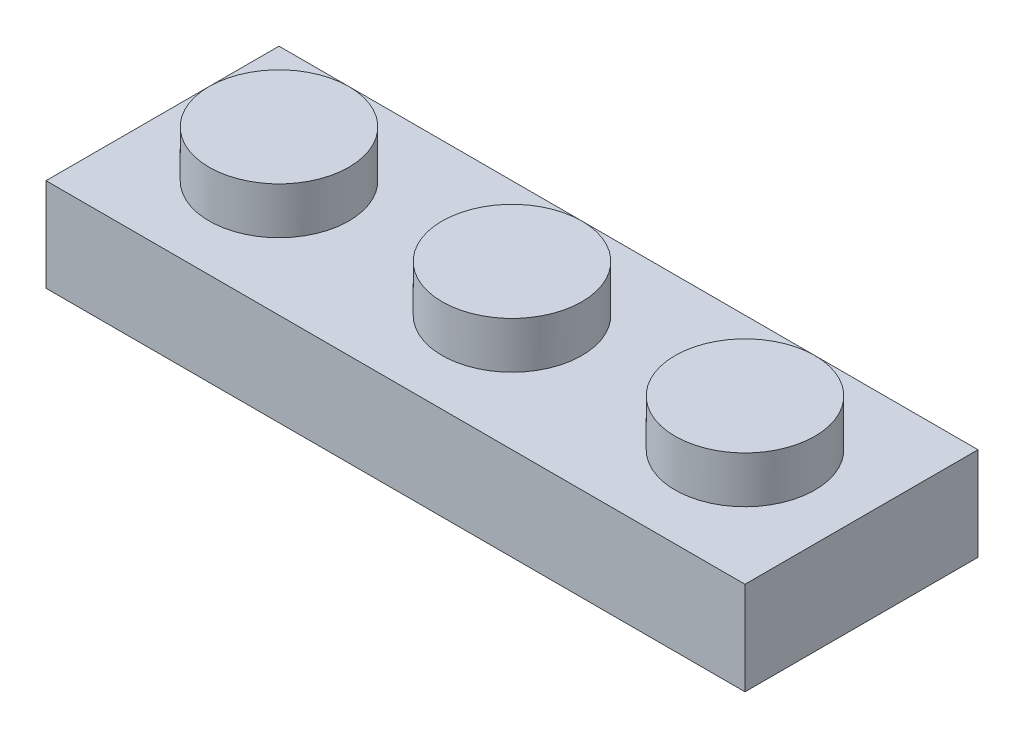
ISO-10303-21;
HEADER;
FILE_DESCRIPTION(('STEP AP214'),'2;1');
FILE_NAME('part.step','',(''),(''),'','','');
FILE_SCHEMA(('AUTOMOTIVE_DESIGN { 1 0 10303 214 1 1 1 1 }'));
ENDSEC;
DATA;
#1=APPLICATION_CONTEXT('core data for automotive mechanical design processes');
#2=APPLICATION_PROTOCOL_DEFINITION('international standard','automotive_design',2000,#1);
#3=PRODUCT_CONTEXT('',#1,'mechanical');
#4=PRODUCT('Part','Part','',(#3));
#5=PRODUCT_RELATED_PRODUCT_CATEGORY('part','',(#4));
#6=PRODUCT_DEFINITION_FORMATION('','',#4);
#7=PRODUCT_DEFINITION_CONTEXT('part definition',#1,'design');
#8=PRODUCT_DEFINITION('design','',#6,#7);
#9=PRODUCT_DEFINITION_SHAPE('','',#8);
#10=(LENGTH_UNIT() NAMED_UNIT(*) SI_UNIT(.MILLI.,.METRE.));
#11=(NAMED_UNIT(*) PLANE_ANGLE_UNIT() SI_UNIT($,.RADIAN.));
#12=(NAMED_UNIT(*) SI_UNIT($,.STERADIAN.) SOLID_ANGLE_UNIT());
#13=UNCERTAINTY_MEASURE_WITH_UNIT(LENGTH_MEASURE(1.E-05),#10,'distance_accuracy_value','');
#14=(GEOMETRIC_REPRESENTATION_CONTEXT(3) GLOBAL_UNCERTAINTY_ASSIGNED_CONTEXT((#13)) GLOBAL_UNIT_ASSIGNED_CONTEXT((#10,
#11,#12)) REPRESENTATION_CONTEXT('',''));
#15=CARTESIAN_POINT('',(0.,0.,0.));
#16=DIRECTION('',(0.,0.,1.));
#17=DIRECTION('',(1.,0.,0.));
#18=AXIS2_PLACEMENT_3D('',#15,#16,#17);
#19=CARTESIAN_POINT('',(0.,0.,0.));
#20=DIRECTION('',(0.,-1.,0.));
#21=DIRECTION('',(0.,0.,-1.));
#22=AXIS2_PLACEMENT_3D('',#19,#20,#21);
#23=PLANE('',#22);
#24=DIRECTION('',(0.,0.,-1.));
#25=VECTOR('',#24,1.);
#26=CARTESIAN_POINT('',(-1.6,0.,-4.));
#27=LINE('',#26,#25);
#28=CARTESIAN_POINT('',(-1.6,0.,2.4));
#29=VERTEX_POINT('',#28);
#30=CARTESIAN_POINT('',(-1.6,0.,-2.4));
#31=VERTEX_POINT('',#30);
#32=EDGE_CURVE('E53',#29,#31,#27,.T.);
#33=ORIENTED_EDGE('',*,*,#32,.T.);
#34=DIRECTION('',(-1.,0.,0.));
#35=VECTOR('',#34,1.);
#36=CARTESIAN_POINT('',(0.,0.,-2.4));
#37=LINE('',#36,#35);
#38=CARTESIAN_POINT('',(-22.4,0.,-2.4));
#39=VERTEX_POINT('',#38);
#40=EDGE_CURVE('E174',#31,#39,#37,.T.);
#41=ORIENTED_EDGE('',*,*,#40,.T.);
#42=DIRECTION('',(0.,0.,1.));
#43=VECTOR('',#42,1.);
#44=CARTESIAN_POINT('',(-22.4,0.,0.));
#45=LINE('',#44,#43);
#46=CARTESIAN_POINT('',(-22.4,0.,2.4));
#47=VERTEX_POINT('',#46);
#48=EDGE_CURVE('E181',#39,#47,#45,.T.);
#49=ORIENTED_EDGE('',*,*,#48,.T.);
#50=DIRECTION('',(1.,0.,0.));
#51=VECTOR('',#50,1.);
#52=CARTESIAN_POINT('',(0.,0.,2.4));
#53=LINE('',#52,#51);
#54=EDGE_CURVE('E58',#47,#29,#53,.T.);
#55=ORIENTED_EDGE('',*,*,#54,.T.);
#56=EDGE_LOOP('',(#33,#41,#49,#55));
#57=FACE_BOUND('',#56,.T.);
#58=DIRECTION('',(0.,0.,-1.));
#59=VECTOR('',#58,1.);
#60=CARTESIAN_POINT('',(0.,0.,4.));
#61=LINE('',#60,#59);
#62=CARTESIAN_POINT('',(0.,0.,4.));
#63=VERTEX_POINT('',#62);
#64=CARTESIAN_POINT('',(0.,0.,-4.));
#65=VERTEX_POINT('',#64);
#66=EDGE_CURVE('E119',#63,#65,#61,.T.);
#67=ORIENTED_EDGE('',*,*,#66,.F.);
#68=DIRECTION('',(1.,0.,0.));
#69=VECTOR('',#68,1.);
#70=CARTESIAN_POINT('',(-24.,0.,4.));
#71=LINE('',#70,#69);
#72=CARTESIAN_POINT('',(-24.,0.,4.));
#73=VERTEX_POINT('',#72);
#74=EDGE_CURVE('E104',#73,#63,#71,.T.);
#75=ORIENTED_EDGE('',*,*,#74,.F.);
#76=DIRECTION('',(0.,0.,1.));
#77=VECTOR('',#76,1.);
#78=CARTESIAN_POINT('',(-24.,0.,4.));
#79=LINE('',#78,#77);
#80=CARTESIAN_POINT('',(-24.,0.,-4.));
#81=VERTEX_POINT('',#80);
#82=EDGE_CURVE('E116',#81,#73,#79,.T.);
#83=ORIENTED_EDGE('',*,*,#82,.F.);
#84=DIRECTION('',(-1.,0.,0.));
#85=VECTOR('',#84,1.);
#86=CARTESIAN_POINT('',(-24.,0.,-4.));
#87=LINE('',#86,#85);
#88=EDGE_CURVE('E120',#65,#81,#87,.T.);
#89=ORIENTED_EDGE('',*,*,#88,.F.);
#90=EDGE_LOOP('',(#67,#75,#83,#89));
#91=FACE_BOUND('',#90,.T.);
#92=ADVANCED_FACE('F38',(#57,#91),#23,.T.);
#93=CARTESIAN_POINT('',(-24.,3.2,-4.));
#94=DIRECTION('',(0.,0.,1.));
#95=DIRECTION('',(1.,0.,0.));
#96=AXIS2_PLACEMENT_3D('',#93,#94,#95);
#97=PLANE('',#96);
#98=DIRECTION('',(-1.,0.,0.));
#99=VECTOR('',#98,1.);
#100=CARTESIAN_POINT('',(-24.,3.2,-4.));
#101=LINE('',#100,#99);
#102=CARTESIAN_POINT('',(0.,3.2,-4.));
#103=VERTEX_POINT('',#102);
#104=CARTESIAN_POINT('',(-24.,3.2,-4.));
#105=VERTEX_POINT('',#104);
#106=EDGE_CURVE('E115',#103,#105,#101,.T.);
#107=ORIENTED_EDGE('',*,*,#106,.F.);
#108=DIRECTION('',(0.,1.,0.));
#109=VECTOR('',#108,1.);
#110=CARTESIAN_POINT('',(0.,0.,-4.));
#111=LINE('',#110,#109);
#112=EDGE_CURVE('E123',#65,#103,#111,.T.);
#113=ORIENTED_EDGE('',*,*,#112,.F.);
#114=ORIENTED_EDGE('',*,*,#88,.T.);
#115=DIRECTION('',(0.,-1.,0.));
#116=VECTOR('',#115,1.);
#117=CARTESIAN_POINT('',(-24.,3.2,-4.));
#118=LINE('',#117,#116);
#119=EDGE_CURVE('E200',#105,#81,#118,.T.);
#120=ORIENTED_EDGE('',*,*,#119,.F.);
#121=EDGE_LOOP('',(#107,#113,#114,#120));
#122=FACE_BOUND('',#121,.T.);
#123=ADVANCED_FACE('F40',(#122),#97,.F.);
#124=CARTESIAN_POINT('',(-24.,3.2,4.));
#125=DIRECTION('',(1.,0.,0.));
#126=DIRECTION('',(0.,0.,-1.));
#127=AXIS2_PLACEMENT_3D('',#124,#125,#126);
#128=PLANE('',#127);
#129=ORIENTED_EDGE('',*,*,#82,.T.);
#130=DIRECTION('',(0.,-1.,0.));
#131=VECTOR('',#130,1.);
#132=CARTESIAN_POINT('',(-24.,3.2,4.));
#133=LINE('',#132,#131);
#134=CARTESIAN_POINT('',(-24.,3.2,4.));
#135=VERTEX_POINT('',#134);
#136=EDGE_CURVE('E112',#135,#73,#133,.T.);
#137=ORIENTED_EDGE('',*,*,#136,.F.);
#138=DIRECTION('',(0.,0.,1.));
#139=VECTOR('',#138,1.);
#140=CARTESIAN_POINT('',(-24.,3.2,4.));
#141=LINE('',#140,#139);
#142=EDGE_CURVE('E193',#105,#135,#141,.T.);
#143=ORIENTED_EDGE('',*,*,#142,.F.);
#144=ORIENTED_EDGE('',*,*,#119,.T.);
#145=EDGE_LOOP('',(#129,#137,#143,#144));
#146=FACE_BOUND('',#145,.T.);
#147=ADVANCED_FACE('F222',(#146),#128,.F.);
#148=CARTESIAN_POINT('',(-24.,3.2,4.));
#149=DIRECTION('',(0.,0.,-1.));
#150=DIRECTION('',(-1.,0.,0.));
#151=AXIS2_PLACEMENT_3D('',#148,#149,#150);
#152=PLANE('',#151);
#153=ORIENTED_EDGE('',*,*,#74,.T.);
#154=DIRECTION('',(0.,-1.,0.));
#155=VECTOR('',#154,1.);
#156=CARTESIAN_POINT('',(0.,0.,4.));
#157=LINE('',#156,#155);
#158=CARTESIAN_POINT('',(0.,3.2,4.));
#159=VERTEX_POINT('',#158);
#160=EDGE_CURVE('E109',#159,#63,#157,.T.);
#161=ORIENTED_EDGE('',*,*,#160,.F.);
#162=DIRECTION('',(1.,0.,0.));
#163=VECTOR('',#162,1.);
#164=CARTESIAN_POINT('',(-24.,3.2,4.));
#165=LINE('',#164,#163);
#166=EDGE_CURVE('E195',#135,#159,#165,.T.);
#167=ORIENTED_EDGE('',*,*,#166,.F.);
#168=ORIENTED_EDGE('',*,*,#136,.T.);
#169=EDGE_LOOP('',(#153,#161,#167,#168));
#170=FACE_BOUND('',#169,.T.);
#171=ADVANCED_FACE('F106',(#170),#152,.F.);
#172=CARTESIAN_POINT('',(0.,3.2,0.));
#173=DIRECTION('',(0.,-1.,0.));
#174=DIRECTION('',(0.,0.,-1.));
#175=AXIS2_PLACEMENT_3D('',#172,#173,#174);
#176=PLANE('',#175);
#177=CARTESIAN_POINT('',(-4.,3.2,0.));
#178=DIRECTION('',(0.,-1.,0.));
#179=DIRECTION('',(0.,0.,-1.));
#180=AXIS2_PLACEMENT_3D('',#177,#178,#179);
#181=CIRCLE('',#180,2.4);
#182=CARTESIAN_POINT('',(-4.,3.2,-2.4));
#183=VERTEX_POINT('',#182);
#184=EDGE_CURVE('E11',#183,#183,#181,.F.);
#185=ORIENTED_EDGE('',*,*,#184,.F.);
#186=EDGE_LOOP('',(#185));
#187=FACE_BOUND('',#186,.T.);
#188=CARTESIAN_POINT('',(-12.,3.2,0.));
#189=DIRECTION('',(0.,-1.,0.));
#190=DIRECTION('',(0.,0.,-1.));
#191=AXIS2_PLACEMENT_3D('',#188,#189,#190);
#192=CIRCLE('',#191,2.4);
#193=CARTESIAN_POINT('',(-12.,3.2,-2.4));
#194=VERTEX_POINT('',#193);
#195=EDGE_CURVE('E46',#194,#194,#192,.F.);
#196=ORIENTED_EDGE('',*,*,#195,.F.);
#197=EDGE_LOOP('',(#196));
#198=FACE_BOUND('',#197,.T.);
#199=CARTESIAN_POINT('',(-20.,3.2,0.));
#200=DIRECTION('',(0.,-1.,0.));
#201=DIRECTION('',(0.,0.,-1.));
#202=AXIS2_PLACEMENT_3D('',#199,#200,#201);
#203=CIRCLE('',#202,2.4);
#204=CARTESIAN_POINT('',(-20.,3.2,-2.4));
#205=VERTEX_POINT('',#204);
#206=EDGE_CURVE('E203',#205,#205,#203,.F.);
#207=ORIENTED_EDGE('',*,*,#206,.F.);
#208=EDGE_LOOP('',(#207));
#209=FACE_BOUND('',#208,.T.);
#210=ORIENTED_EDGE('',*,*,#166,.T.);
#211=DIRECTION('',(0.,0.,-1.));
#212=VECTOR('',#211,1.);
#213=CARTESIAN_POINT('',(0.,3.2,0.));
#214=LINE('',#213,#212);
#215=EDGE_CURVE('E127',#159,#103,#214,.T.);
#216=ORIENTED_EDGE('',*,*,#215,.T.);
#217=ORIENTED_EDGE('',*,*,#106,.T.);
#218=ORIENTED_EDGE('',*,*,#142,.T.);
#219=EDGE_LOOP('',(#210,#216,#217,#218));
#220=FACE_BOUND('',#219,.T.);
#221=ADVANCED_FACE('F210',(#187,#198,#209,#220),#176,.F.);
#222=CARTESIAN_POINT('',(-20.,4.8,0.));
#223=DIRECTION('',(0.,-1.,0.));
#224=DIRECTION('',(0.,0.,-1.));
#225=AXIS2_PLACEMENT_3D('',#222,#223,#224);
#226=CYLINDRICAL_SURFACE('',#225,2.4);
#227=CARTESIAN_POINT('',(-20.,4.8,0.));
#228=DIRECTION('',(0.,1.,0.));
#229=DIRECTION('',(0.,0.,1.));
#230=AXIS2_PLACEMENT_3D('',#227,#228,#229);
#231=CIRCLE('',#230,2.4);
#232=CARTESIAN_POINT('',(-20.,4.8,2.4));
#233=VERTEX_POINT('',#232);
#234=EDGE_CURVE('E189',#233,#233,#231,.T.);
#235=ORIENTED_EDGE('',*,*,#234,.F.);
#236=EDGE_LOOP('',(#235));
#237=FACE_BOUND('',#236,.T.);
#238=ORIENTED_EDGE('',*,*,#206,.T.);
#239=EDGE_LOOP('',(#238));
#240=FACE_BOUND('',#239,.T.);
#241=ADVANCED_FACE('F213',(#237,#240),#226,.T.);
#242=CARTESIAN_POINT('',(-20.,4.8,0.));
#243=DIRECTION('',(0.,1.,0.));
#244=DIRECTION('',(0.,0.,1.));
#245=AXIS2_PLACEMENT_3D('',#242,#243,#244);
#246=PLANE('',#245);
#247=ORIENTED_EDGE('',*,*,#234,.T.);
#248=EDGE_LOOP('',(#247));
#249=FACE_BOUND('',#248,.T.);
#250=ADVANCED_FACE('F291',(#249),#246,.T.);
#251=CARTESIAN_POINT('',(-12.,4.8,0.));
#252=DIRECTION('',(0.,-1.,0.));
#253=DIRECTION('',(0.,0.,-1.));
#254=AXIS2_PLACEMENT_3D('',#251,#252,#253);
#255=CYLINDRICAL_SURFACE('',#254,2.4);
#256=CARTESIAN_POINT('',(-12.,4.8,0.));
#257=DIRECTION('',(0.,1.,0.));
#258=DIRECTION('',(0.,0.,1.));
#259=AXIS2_PLACEMENT_3D('',#256,#257,#258);
#260=CIRCLE('',#259,2.4);
#261=CARTESIAN_POINT('',(-12.,4.8,2.4));
#262=VERTEX_POINT('',#261);
#263=EDGE_CURVE('E186',#262,#262,#260,.T.);
#264=ORIENTED_EDGE('',*,*,#263,.F.);
#265=EDGE_LOOP('',(#264));
#266=FACE_BOUND('',#265,.T.);
#267=ORIENTED_EDGE('',*,*,#195,.T.);
#268=EDGE_LOOP('',(#267));
#269=FACE_BOUND('',#268,.T.);
#270=ADVANCED_FACE('F208',(#266,#269),#255,.T.);
#271=CARTESIAN_POINT('',(-12.,4.8,0.));
#272=DIRECTION('',(0.,1.,0.));
#273=DIRECTION('',(0.,0.,1.));
#274=AXIS2_PLACEMENT_3D('',#271,#272,#273);
#275=PLANE('',#274);
#276=ORIENTED_EDGE('',*,*,#263,.T.);
#277=EDGE_LOOP('',(#276));
#278=FACE_BOUND('',#277,.T.);
#279=ADVANCED_FACE('F284',(#278),#275,.T.);
#280=CARTESIAN_POINT('',(-4.,4.8,0.));
#281=DIRECTION('',(0.,-1.,0.));
#282=DIRECTION('',(0.,0.,-1.));
#283=AXIS2_PLACEMENT_3D('',#280,#281,#282);
#284=CYLINDRICAL_SURFACE('',#283,2.4);
#285=CARTESIAN_POINT('',(-4.,4.8,0.));
#286=DIRECTION('',(0.,1.,0.));
#287=DIRECTION('',(0.,0.,1.));
#288=AXIS2_PLACEMENT_3D('',#285,#286,#287);
#289=CIRCLE('',#288,2.4);
#290=CARTESIAN_POINT('',(-4.,4.8,2.4));
#291=VERTEX_POINT('',#290);
#292=EDGE_CURVE('E165',#291,#291,#289,.T.);
#293=ORIENTED_EDGE('',*,*,#292,.F.);
#294=EDGE_LOOP('',(#293));
#295=FACE_BOUND('',#294,.T.);
#296=ORIENTED_EDGE('',*,*,#184,.T.);
#297=EDGE_LOOP('',(#296));
#298=FACE_BOUND('',#297,.T.);
#299=ADVANCED_FACE('F280',(#295,#298),#284,.T.);
#300=CARTESIAN_POINT('',(-4.,4.8,0.));
#301=DIRECTION('',(0.,1.,0.));
#302=DIRECTION('',(0.,0.,1.));
#303=AXIS2_PLACEMENT_3D('',#300,#301,#302);
#304=PLANE('',#303);
#305=ORIENTED_EDGE('',*,*,#292,.T.);
#306=EDGE_LOOP('',(#305));
#307=FACE_BOUND('',#306,.T.);
#308=ADVANCED_FACE('F240',(#307),#304,.T.);
#309=CARTESIAN_POINT('',(-24.,3.2,-2.4));
#310=DIRECTION('',(0.,0.,1.));
#311=DIRECTION('',(1.,0.,0.));
#312=AXIS2_PLACEMENT_3D('',#309,#310,#311);
#313=PLANE('',#312);
#314=DIRECTION('',(-1.,0.,0.));
#315=VECTOR('',#314,1.);
#316=CARTESIAN_POINT('',(0.,1.6,-2.4));
#317=LINE('',#316,#315);
#318=CARTESIAN_POINT('',(-1.6,1.6,-2.4));
#319=VERTEX_POINT('',#318);
#320=CARTESIAN_POINT('',(-22.4,1.6,-2.4));
#321=VERTEX_POINT('',#320);
#322=EDGE_CURVE('E155',#319,#321,#317,.T.);
#323=ORIENTED_EDGE('',*,*,#322,.T.);
#324=DIRECTION('',(0.,-1.,0.));
#325=VECTOR('',#324,1.);
#326=CARTESIAN_POINT('',(-22.4,3.2,-2.4));
#327=LINE('',#326,#325);
#328=EDGE_CURVE('E150',#321,#39,#327,.T.);
#329=ORIENTED_EDGE('',*,*,#328,.T.);
#330=ORIENTED_EDGE('',*,*,#40,.F.);
#331=DIRECTION('',(0.,-1.,0.));
#332=VECTOR('',#331,1.);
#333=CARTESIAN_POINT('',(-1.6,3.2,-2.4));
#334=LINE('',#333,#332);
#335=EDGE_CURVE('E493',#319,#31,#334,.T.);
#336=ORIENTED_EDGE('',*,*,#335,.F.);
#337=EDGE_LOOP('',(#323,#329,#330,#336));
#338=FACE_BOUND('',#337,.T.);
#339=ADVANCED_FACE('F236',(#338),#313,.T.);
#340=CARTESIAN_POINT('',(-22.4,3.2,4.));
#341=DIRECTION('',(1.,0.,0.));
#342=DIRECTION('',(0.,0.,-1.));
#343=AXIS2_PLACEMENT_3D('',#340,#341,#342);
#344=PLANE('',#343);
#345=ORIENTED_EDGE('',*,*,#48,.F.);
#346=ORIENTED_EDGE('',*,*,#328,.F.);
#347=DIRECTION('',(0.,0.,1.));
#348=VECTOR('',#347,1.);
#349=CARTESIAN_POINT('',(-22.4,1.6,0.));
#350=LINE('',#349,#348);
#351=CARTESIAN_POINT('',(-22.4,1.6,2.4));
#352=VERTEX_POINT('',#351);
#353=EDGE_CURVE('E157',#321,#352,#350,.T.);
#354=ORIENTED_EDGE('',*,*,#353,.T.);
#355=DIRECTION('',(0.,-1.,0.));
#356=VECTOR('',#355,1.);
#357=CARTESIAN_POINT('',(-22.4,3.2,2.4));
#358=LINE('',#357,#356);
#359=EDGE_CURVE('E154',#352,#47,#358,.T.);
#360=ORIENTED_EDGE('',*,*,#359,.T.);
#361=EDGE_LOOP('',(#345,#346,#354,#360));
#362=FACE_BOUND('',#361,.T.);
#363=ADVANCED_FACE('F239',(#362),#344,.T.);
#364=CARTESIAN_POINT('',(-24.,3.2,2.4));
#365=DIRECTION('',(0.,0.,-1.));
#366=DIRECTION('',(-1.,0.,0.));
#367=AXIS2_PLACEMENT_3D('',#364,#365,#366);
#368=PLANE('',#367);
#369=DIRECTION('',(0.,1.,0.));
#370=VECTOR('',#369,1.);
#371=CARTESIAN_POINT('',(-1.6,3.2,2.4));
#372=LINE('',#371,#370);
#373=CARTESIAN_POINT('',(-1.6,1.6,2.4));
#374=VERTEX_POINT('',#373);
#375=EDGE_CURVE('E128',#29,#374,#372,.T.);
#376=ORIENTED_EDGE('',*,*,#375,.F.);
#377=ORIENTED_EDGE('',*,*,#54,.F.);
#378=ORIENTED_EDGE('',*,*,#359,.F.);
#379=DIRECTION('',(1.,0.,0.));
#380=VECTOR('',#379,1.);
#381=CARTESIAN_POINT('',(0.,1.6,2.4));
#382=LINE('',#381,#380);
#383=EDGE_CURVE('E159',#352,#374,#382,.T.);
#384=ORIENTED_EDGE('',*,*,#383,.T.);
#385=EDGE_LOOP('',(#376,#377,#378,#384));
#386=FACE_BOUND('',#385,.T.);
#387=ADVANCED_FACE('F244',(#386),#368,.T.);
#388=CARTESIAN_POINT('',(0.,1.6,0.));
#389=DIRECTION('',(0.,-1.,0.));
#390=DIRECTION('',(0.,0.,-1.));
#391=AXIS2_PLACEMENT_3D('',#388,#389,#390);
#392=PLANE('',#391);
#393=CARTESIAN_POINT('',(-4.,1.6,0.));
#394=DIRECTION('',(0.,-1.,0.));
#395=DIRECTION('',(0.,0.,-1.));
#396=AXIS2_PLACEMENT_3D('',#393,#394,#395);
#397=CIRCLE('',#396,0.800000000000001);
#398=CARTESIAN_POINT('',(-4.,1.6,-0.800000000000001));
#399=VERTEX_POINT('',#398);
#400=EDGE_CURVE('E162',#399,#399,#397,.F.);
#401=ORIENTED_EDGE('',*,*,#400,.T.);
#402=EDGE_LOOP('',(#401));
#403=FACE_BOUND('',#402,.T.);
#404=ORIENTED_EDGE('',*,*,#353,.F.);
#405=ORIENTED_EDGE('',*,*,#322,.F.);
#406=DIRECTION('',(0.,0.,-1.));
#407=VECTOR('',#406,1.);
#408=CARTESIAN_POINT('',(-1.6,1.6,0.));
#409=LINE('',#408,#407);
#410=EDGE_CURVE('E131',#374,#319,#409,.T.);
#411=ORIENTED_EDGE('',*,*,#410,.F.);
#412=ORIENTED_EDGE('',*,*,#383,.F.);
#413=EDGE_LOOP('',(#404,#405,#411,#412));
#414=FACE_BOUND('',#413,.T.);
#415=CARTESIAN_POINT('',(-16.,1.6,-1.1172740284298E-13));
#416=DIRECTION('',(0.,-1.,0.));
#417=DIRECTION('',(0.,0.,-1.));
#418=AXIS2_PLACEMENT_3D('',#415,#416,#417);
#419=CIRCLE('',#418,1.76964773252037);
#420=CARTESIAN_POINT('',(-16.,1.6,-1.76964773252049));
#421=VERTEX_POINT('',#420);
#422=EDGE_CURVE('E137',#421,#421,#419,.T.);
#423=ORIENTED_EDGE('',*,*,#422,.F.);
#424=EDGE_LOOP('',(#423));
#425=FACE_BOUND('',#424,.T.);
#426=CARTESIAN_POINT('',(-8.,1.6,0.));
#427=DIRECTION('',(0.,-1.,0.));
#428=DIRECTION('',(0.,0.,-1.));
#429=AXIS2_PLACEMENT_3D('',#426,#427,#428);
#430=CIRCLE('',#429,1.76964773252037);
#431=CARTESIAN_POINT('',(-8.,1.6,-1.76964773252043));
#432=VERTEX_POINT('',#431);
#433=EDGE_CURVE('E143',#432,#432,#430,.T.);
#434=ORIENTED_EDGE('',*,*,#433,.F.);
#435=EDGE_LOOP('',(#434));
#436=FACE_BOUND('',#435,.T.);
#437=CARTESIAN_POINT('',(-12.,1.6,0.));
#438=DIRECTION('',(0.,-1.,0.));
#439=DIRECTION('',(0.,0.,-1.));
#440=AXIS2_PLACEMENT_3D('',#437,#438,#439);
#441=CIRCLE('',#440,0.800000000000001);
#442=CARTESIAN_POINT('',(-12.,1.6,-0.800000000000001));
#443=VERTEX_POINT('',#442);
#444=EDGE_CURVE('E166',#443,#443,#441,.F.);
#445=ORIENTED_EDGE('',*,*,#444,.T.);
#446=EDGE_LOOP('',(#445));
#447=FACE_BOUND('',#446,.T.);
#448=CARTESIAN_POINT('',(-20.,1.6,0.));
#449=DIRECTION('',(0.,-1.,0.));
#450=DIRECTION('',(0.,0.,-1.));
#451=AXIS2_PLACEMENT_3D('',#448,#449,#450);
#452=CIRCLE('',#451,0.800000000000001);
#453=CARTESIAN_POINT('',(-20.,1.6,-0.800000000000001));
#454=VERTEX_POINT('',#453);
#455=EDGE_CURVE('E153',#454,#454,#452,.F.);
#456=ORIENTED_EDGE('',*,*,#455,.T.);
#457=EDGE_LOOP('',(#456));
#458=FACE_BOUND('',#457,.T.);
#459=ADVANCED_FACE('F248',(#403,#414,#425,#436,#447,#458),#392,.T.);
#460=CARTESIAN_POINT('',(-20.,4.8,0.));
#461=DIRECTION('',(0.,-1.,0.));
#462=DIRECTION('',(0.,0.,-1.));
#463=AXIS2_PLACEMENT_3D('',#460,#461,#462);
#464=CYLINDRICAL_SURFACE('',#463,0.800000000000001);
#465=CARTESIAN_POINT('',(-20.,3.2,0.));
#466=DIRECTION('',(0.,1.,0.));
#467=DIRECTION('',(0.,0.,1.));
#468=AXIS2_PLACEMENT_3D('',#465,#466,#467);
#469=CIRCLE('',#468,0.800000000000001);
#470=CARTESIAN_POINT('',(-20.,3.2,0.800000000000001));
#471=VERTEX_POINT('',#470);
#472=EDGE_CURVE('E171',#471,#471,#469,.T.);
#473=ORIENTED_EDGE('',*,*,#472,.T.);
#474=EDGE_LOOP('',(#473));
#475=FACE_BOUND('',#474,.T.);
#476=ORIENTED_EDGE('',*,*,#455,.F.);
#477=EDGE_LOOP('',(#476));
#478=FACE_BOUND('',#477,.T.);
#479=ADVANCED_FACE('F252',(#475,#478),#464,.F.);
#480=CARTESIAN_POINT('',(-20.,3.2,0.));
#481=DIRECTION('',(0.,1.,0.));
#482=DIRECTION('',(0.,0.,1.));
#483=AXIS2_PLACEMENT_3D('',#480,#481,#482);
#484=PLANE('',#483);
#485=ORIENTED_EDGE('',*,*,#472,.F.);
#486=EDGE_LOOP('',(#485));
#487=FACE_BOUND('',#486,.T.);
#488=ADVANCED_FACE('F256',(#487),#484,.F.);
#489=CARTESIAN_POINT('',(-12.,4.8,0.));
#490=DIRECTION('',(0.,-1.,0.));
#491=DIRECTION('',(0.,0.,-1.));
#492=AXIS2_PLACEMENT_3D('',#489,#490,#491);
#493=CYLINDRICAL_SURFACE('',#492,0.800000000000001);
#494=CARTESIAN_POINT('',(-12.,3.2,0.));
#495=DIRECTION('',(0.,1.,0.));
#496=DIRECTION('',(0.,0.,1.));
#497=AXIS2_PLACEMENT_3D('',#494,#495,#496);
#498=CIRCLE('',#497,0.800000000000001);
#499=CARTESIAN_POINT('',(-12.,3.2,0.800000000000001));
#500=VERTEX_POINT('',#499);
#501=EDGE_CURVE('E175',#500,#500,#498,.T.);
#502=ORIENTED_EDGE('',*,*,#501,.T.);
#503=EDGE_LOOP('',(#502));
#504=FACE_BOUND('',#503,.T.);
#505=ORIENTED_EDGE('',*,*,#444,.F.);
#506=EDGE_LOOP('',(#505));
#507=FACE_BOUND('',#506,.T.);
#508=ADVANCED_FACE('F260',(#504,#507),#493,.F.);
#509=CARTESIAN_POINT('',(-12.,3.2,0.));
#510=DIRECTION('',(0.,1.,0.));
#511=DIRECTION('',(0.,0.,1.));
#512=AXIS2_PLACEMENT_3D('',#509,#510,#511);
#513=PLANE('',#512);
#514=ORIENTED_EDGE('',*,*,#501,.F.);
#515=EDGE_LOOP('',(#514));
#516=FACE_BOUND('',#515,.T.);
#517=ADVANCED_FACE('F264',(#516),#513,.F.);
#518=CARTESIAN_POINT('',(-4.,4.8,0.));
#519=DIRECTION('',(0.,-1.,0.));
#520=DIRECTION('',(0.,0.,-1.));
#521=AXIS2_PLACEMENT_3D('',#518,#519,#520);
#522=CYLINDRICAL_SURFACE('',#521,0.800000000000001);
#523=CARTESIAN_POINT('',(-4.,3.2,0.));
#524=DIRECTION('',(0.,1.,0.));
#525=DIRECTION('',(0.,0.,1.));
#526=AXIS2_PLACEMENT_3D('',#523,#524,#525);
#527=CIRCLE('',#526,0.800000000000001);
#528=CARTESIAN_POINT('',(-4.,3.2,0.800000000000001));
#529=VERTEX_POINT('',#528);
#530=EDGE_CURVE('E149',#529,#529,#527,.T.);
#531=ORIENTED_EDGE('',*,*,#530,.T.);
#532=EDGE_LOOP('',(#531));
#533=FACE_BOUND('',#532,.T.);
#534=ORIENTED_EDGE('',*,*,#400,.F.);
#535=EDGE_LOOP('',(#534));
#536=FACE_BOUND('',#535,.T.);
#537=ADVANCED_FACE('F268',(#533,#536),#522,.F.);
#538=CARTESIAN_POINT('',(-4.,3.2,0.));
#539=DIRECTION('',(0.,1.,0.));
#540=DIRECTION('',(0.,0.,1.));
#541=AXIS2_PLACEMENT_3D('',#538,#539,#540);
#542=PLANE('',#541);
#543=ORIENTED_EDGE('',*,*,#530,.F.);
#544=EDGE_LOOP('',(#543));
#545=FACE_BOUND('',#544,.T.);
#546=ADVANCED_FACE('F272',(#545),#542,.F.);
#547=CARTESIAN_POINT('',(-8.,-5.00531964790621,0.));
#548=DIRECTION('',(0.,1.,0.));
#549=DIRECTION('',(0.,0.,1.));
#550=AXIS2_PLACEMENT_3D('',#547,#548,#549);
#551=CYLINDRICAL_SURFACE('',#550,1.76964773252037);
#552=ORIENTED_EDGE('',*,*,#433,.T.);
#553=EDGE_LOOP('',(#552));
#554=FACE_BOUND('',#553,.T.);
#555=CARTESIAN_POINT('',(-8.,0.,0.));
#556=DIRECTION('',(0.,-1.,0.));
#557=DIRECTION('',(0.,0.,-1.));
#558=AXIS2_PLACEMENT_3D('',#555,#556,#557);
#559=CIRCLE('',#558,1.76964773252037);
#560=CARTESIAN_POINT('',(-8.,0.,-1.76964773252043));
#561=VERTEX_POINT('',#560);
#562=EDGE_CURVE('E146',#561,#561,#559,.T.);
#563=ORIENTED_EDGE('',*,*,#562,.F.);
#564=EDGE_LOOP('',(#563));
#565=FACE_BOUND('',#564,.T.);
#566=ADVANCED_FACE('F276',(#554,#565),#551,.T.);
#567=CARTESIAN_POINT('',(0.,0.,0.));
#568=DIRECTION('',(0.,-1.,0.));
#569=DIRECTION('',(0.,0.,-1.));
#570=AXIS2_PLACEMENT_3D('',#567,#568,#569);
#571=PLANE('',#570);
#572=ORIENTED_EDGE('',*,*,#562,.T.);
#573=EDGE_LOOP('',(#572));
#574=FACE_BOUND('',#573,.T.);
#575=ADVANCED_FACE('F234',(#574),#571,.T.);
#576=CARTESIAN_POINT('',(-16.,-5.00531964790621,-1.1172740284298E-13));
#577=DIRECTION('',(0.,1.,0.));
#578=DIRECTION('',(0.,0.,1.));
#579=AXIS2_PLACEMENT_3D('',#576,#577,#578);
#580=CYLINDRICAL_SURFACE('',#579,1.76964773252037);
#581=ORIENTED_EDGE('',*,*,#422,.T.);
#582=EDGE_LOOP('',(#581));
#583=FACE_BOUND('',#582,.T.);
#584=CARTESIAN_POINT('',(-16.,0.,-1.1172740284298E-13));
#585=DIRECTION('',(0.,-1.,0.));
#586=DIRECTION('',(0.,0.,-1.));
#587=AXIS2_PLACEMENT_3D('',#584,#585,#586);
#588=CIRCLE('',#587,1.76964773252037);
#589=CARTESIAN_POINT('',(-16.,0.,-1.76964773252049));
#590=VERTEX_POINT('',#589);
#591=EDGE_CURVE('E140',#590,#590,#588,.T.);
#592=ORIENTED_EDGE('',*,*,#591,.F.);
#593=EDGE_LOOP('',(#592));
#594=FACE_BOUND('',#593,.T.);
#595=ADVANCED_FACE('F387',(#583,#594),#580,.T.);
#596=CARTESIAN_POINT('',(0.,0.,0.));
#597=DIRECTION('',(0.,-1.,0.));
#598=DIRECTION('',(0.,0.,-1.));
#599=AXIS2_PLACEMENT_3D('',#596,#597,#598);
#600=PLANE('',#599);
#601=ORIENTED_EDGE('',*,*,#591,.T.);
#602=EDGE_LOOP('',(#601));
#603=FACE_BOUND('',#602,.T.);
#604=ADVANCED_FACE('F394',(#603),#600,.T.);
#605=CARTESIAN_POINT('',(0.,0.,0.));
#606=DIRECTION('',(-1.,0.,0.));
#607=DIRECTION('',(0.,0.,1.));
#608=AXIS2_PLACEMENT_3D('',#605,#606,#607);
#609=PLANE('',#608);
#610=ORIENTED_EDGE('',*,*,#66,.T.);
#611=ORIENTED_EDGE('',*,*,#112,.T.);
#612=ORIENTED_EDGE('',*,*,#215,.F.);
#613=ORIENTED_EDGE('',*,*,#160,.T.);
#614=EDGE_LOOP('',(#610,#611,#612,#613));
#615=FACE_BOUND('',#614,.T.);
#616=ADVANCED_FACE('F125',(#615),#609,.F.);
#617=CARTESIAN_POINT('',(-1.6,0.,0.));
#618=DIRECTION('',(-1.,0.,0.));
#619=DIRECTION('',(0.,0.,1.));
#620=AXIS2_PLACEMENT_3D('',#617,#618,#619);
#621=PLANE('',#620);
#622=ORIENTED_EDGE('',*,*,#32,.F.);
#623=ORIENTED_EDGE('',*,*,#375,.T.);
#624=ORIENTED_EDGE('',*,*,#410,.T.);
#625=ORIENTED_EDGE('',*,*,#335,.T.);
#626=EDGE_LOOP('',(#622,#623,#624,#625));
#627=FACE_BOUND('',#626,.T.);
#628=ADVANCED_FACE('F407',(#627),#621,.T.);
#629=CLOSED_SHELL('',(#92,#123,#147,#171,#221,#241,#250,#270,#279,#299,#308,#339,#363,#387,#459,
#479,#488,#508,#517,#537,#546,#566,#575,#595,#604,#616,#628));
#630=MANIFOLD_SOLID_BREP('B2',#629);
#631=ADVANCED_BREP_SHAPE_REPRESENTATION('',(#18,#630),#14);
#632=SHAPE_DEFINITION_REPRESENTATION(#9,#631);
ENDSEC;
END-ISO-10303-21;
